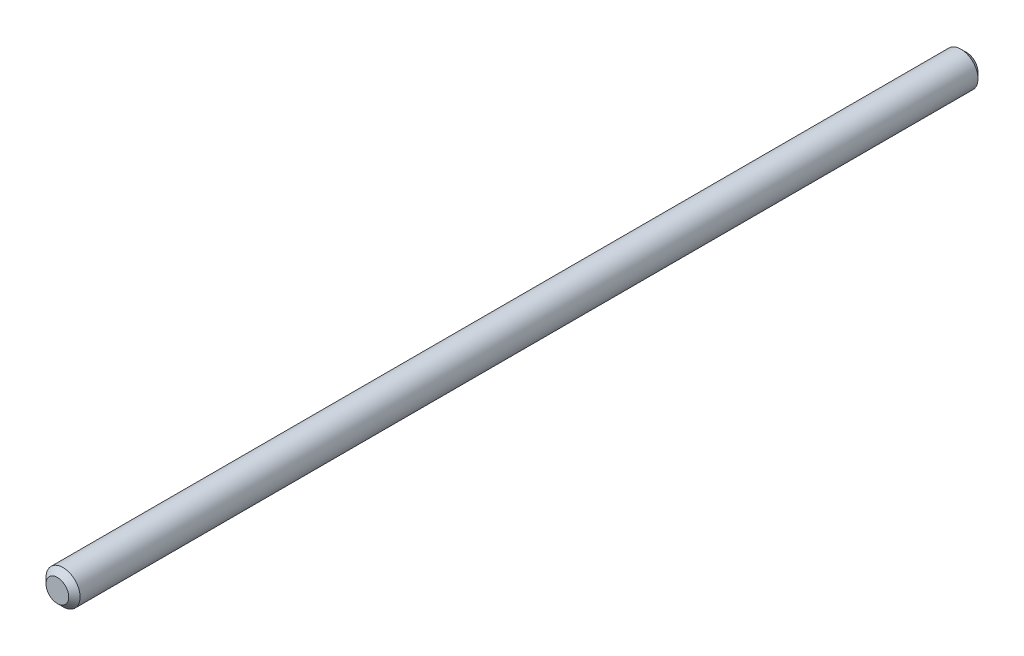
from build123d import *

# Parameters (mm, degrees)
ESQUISSE1_R          = 1.5
BASE_EXTRUSION_DEPTH = 80
CHANFREIN1_SIZE      = 0.5


with BuildPart() as part:
    # Esquisse1 → Base-Extrusion (new body)
    with BuildSketch(Plane.XY):
        with Locations(Location((0, 0, 0), (0, 0, 180))):
            Circle(ESQUISSE1_R)
    extrude(amount=BASE_EXTRUSION_DEPTH)

    # Chanfrein1
    chanfrein1_edges = [part.edges().sort_by_distance(p)[0] for p in [
        (1.5, 0, 0),
        (1.5, 0, 80),
    ]]
    chamfer(chanfrein1_edges, length=CHANFREIN1_SIZE)


solid = part.part
